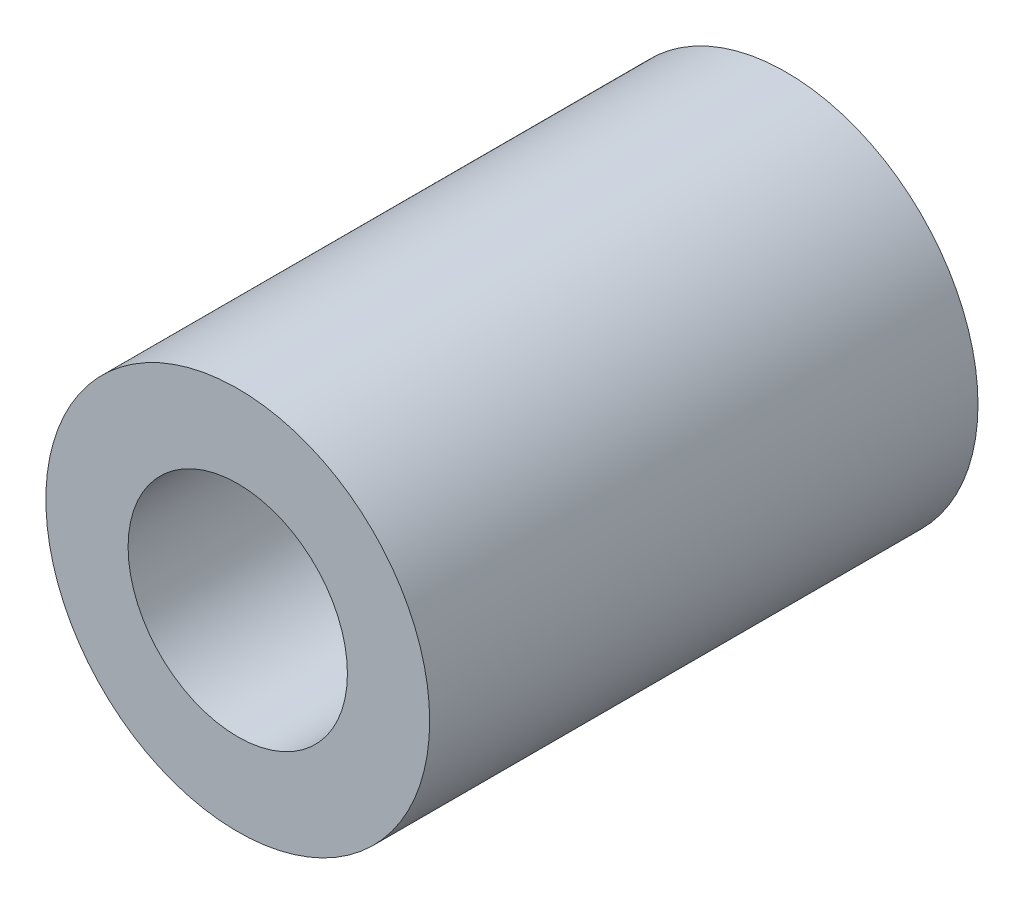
ISO-10303-21;
HEADER;
FILE_DESCRIPTION(('STEP AP214'),'2;1');
FILE_NAME('part.step','',(''),(''),'','','');
FILE_SCHEMA(('AUTOMOTIVE_DESIGN { 1 0 10303 214 1 1 1 1 }'));
ENDSEC;
DATA;
#1=APPLICATION_CONTEXT('core data for automotive mechanical design processes');
#2=APPLICATION_PROTOCOL_DEFINITION('international standard','automotive_design',2000,#1);
#3=PRODUCT_CONTEXT('',#1,'mechanical');
#4=PRODUCT('Part','Part','',(#3));
#5=PRODUCT_RELATED_PRODUCT_CATEGORY('part','',(#4));
#6=PRODUCT_DEFINITION_FORMATION('','',#4);
#7=PRODUCT_DEFINITION_CONTEXT('part definition',#1,'design');
#8=PRODUCT_DEFINITION('design','',#6,#7);
#9=PRODUCT_DEFINITION_SHAPE('','',#8);
#10=(LENGTH_UNIT() NAMED_UNIT(*) SI_UNIT(.MILLI.,.METRE.));
#11=(NAMED_UNIT(*) PLANE_ANGLE_UNIT() SI_UNIT($,.RADIAN.));
#12=(NAMED_UNIT(*) SI_UNIT($,.STERADIAN.) SOLID_ANGLE_UNIT());
#13=UNCERTAINTY_MEASURE_WITH_UNIT(LENGTH_MEASURE(1.E-05),#10,'distance_accuracy_value','');
#14=(GEOMETRIC_REPRESENTATION_CONTEXT(3) GLOBAL_UNCERTAINTY_ASSIGNED_CONTEXT((#13)) GLOBAL_UNIT_ASSIGNED_CONTEXT((#10,
#11,#12)) REPRESENTATION_CONTEXT('',''));
#15=CARTESIAN_POINT('',(0.,0.,0.));
#16=DIRECTION('',(0.,0.,1.));
#17=DIRECTION('',(1.,0.,0.));
#18=AXIS2_PLACEMENT_3D('',#15,#16,#17);
#19=CARTESIAN_POINT('',(0.,0.,10.));
#20=DIRECTION('',(0.,0.,1.));
#21=DIRECTION('',(1.,0.,0.));
#22=AXIS2_PLACEMENT_3D('',#19,#20,#21);
#23=PLANE('',#22);
#24=CARTESIAN_POINT('',(0.,0.,10.));
#25=DIRECTION('',(0.,0.,1.));
#26=DIRECTION('',(1.,0.,0.));
#27=AXIS2_PLACEMENT_3D('',#24,#25,#26);
#28=CIRCLE('',#27,3.5);
#29=CARTESIAN_POINT('',(3.5,0.,10.));
#30=VERTEX_POINT('',#29);
#31=EDGE_CURVE('E10',#30,#30,#28,.T.);
#32=ORIENTED_EDGE('',*,*,#31,.T.);
#33=EDGE_LOOP('',(#32));
#34=FACE_BOUND('',#33,.T.);
#35=CARTESIAN_POINT('',(0.,0.,10.));
#36=DIRECTION('',(0.,0.,1.));
#37=DIRECTION('',(1.,0.,0.));
#38=AXIS2_PLACEMENT_3D('',#35,#36,#37);
#39=CIRCLE('',#38,2.);
#40=CARTESIAN_POINT('',(2.,0.,10.));
#41=VERTEX_POINT('',#40);
#42=EDGE_CURVE('E42',#41,#41,#39,.T.);
#43=ORIENTED_EDGE('',*,*,#42,.F.);
#44=EDGE_LOOP('',(#43));
#45=FACE_BOUND('',#44,.T.);
#46=ADVANCED_FACE('F31',(#34,#45),#23,.T.);
#47=CARTESIAN_POINT('',(0.,0.,0.));
#48=DIRECTION('',(0.,0.,1.));
#49=DIRECTION('',(1.,0.,0.));
#50=AXIS2_PLACEMENT_3D('',#47,#48,#49);
#51=PLANE('',#50);
#52=CARTESIAN_POINT('',(0.,0.,0.));
#53=DIRECTION('',(0.,0.,1.));
#54=DIRECTION('',(1.,0.,0.));
#55=AXIS2_PLACEMENT_3D('',#52,#53,#54);
#56=CIRCLE('',#55,3.5);
#57=CARTESIAN_POINT('',(3.5,0.,0.));
#58=VERTEX_POINT('',#57);
#59=EDGE_CURVE('E35',#58,#58,#56,.T.);
#60=ORIENTED_EDGE('',*,*,#59,.F.);
#61=EDGE_LOOP('',(#60));
#62=FACE_BOUND('',#61,.T.);
#63=CARTESIAN_POINT('',(0.,0.,0.));
#64=DIRECTION('',(0.,0.,1.));
#65=DIRECTION('',(1.,0.,0.));
#66=AXIS2_PLACEMENT_3D('',#63,#64,#65);
#67=CIRCLE('',#66,2.);
#68=CARTESIAN_POINT('',(2.,0.,0.));
#69=VERTEX_POINT('',#68);
#70=EDGE_CURVE('E44',#69,#69,#67,.T.);
#71=ORIENTED_EDGE('',*,*,#70,.T.);
#72=EDGE_LOOP('',(#71));
#73=FACE_BOUND('',#72,.T.);
#74=ADVANCED_FACE('F54',(#62,#73),#51,.F.);
#75=CARTESIAN_POINT('',(0.,0.,10.));
#76=DIRECTION('',(0.,0.,-1.));
#77=DIRECTION('',(-1.,0.,0.));
#78=AXIS2_PLACEMENT_3D('',#75,#76,#77);
#79=CYLINDRICAL_SURFACE('',#78,3.5);
#80=ORIENTED_EDGE('',*,*,#31,.F.);
#81=EDGE_LOOP('',(#80));
#82=FACE_BOUND('',#81,.T.);
#83=ORIENTED_EDGE('',*,*,#59,.T.);
#84=EDGE_LOOP('',(#83));
#85=FACE_BOUND('',#84,.T.);
#86=ADVANCED_FACE('F33',(#82,#85),#79,.T.);
#87=CARTESIAN_POINT('',(0.,0.,10.));
#88=DIRECTION('',(0.,0.,-1.));
#89=DIRECTION('',(-1.,0.,0.));
#90=AXIS2_PLACEMENT_3D('',#87,#88,#89);
#91=CYLINDRICAL_SURFACE('',#90,2.);
#92=ORIENTED_EDGE('',*,*,#42,.T.);
#93=EDGE_LOOP('',(#92));
#94=FACE_BOUND('',#93,.T.);
#95=ORIENTED_EDGE('',*,*,#70,.F.);
#96=EDGE_LOOP('',(#95));
#97=FACE_BOUND('',#96,.T.);
#98=ADVANCED_FACE('F50',(#94,#97),#91,.F.);
#99=CLOSED_SHELL('',(#46,#74,#86,#98));
#100=MANIFOLD_SOLID_BREP('B2',#99);
#101=ADVANCED_BREP_SHAPE_REPRESENTATION('',(#18,#100),#14);
#102=SHAPE_DEFINITION_REPRESENTATION(#9,#101);
ENDSEC;
END-ISO-10303-21;
